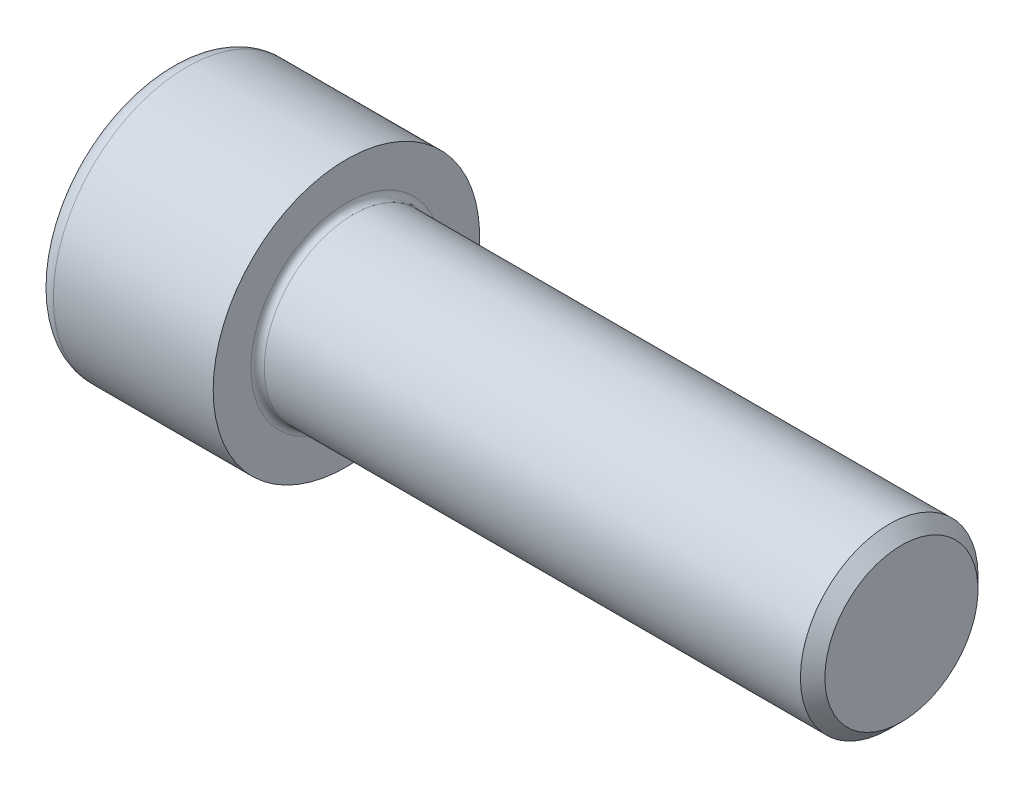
ISO-10303-21;
HEADER;
FILE_DESCRIPTION(('STEP AP214'),'2;1');
FILE_NAME('part.step','',(''),(''),'','','');
FILE_SCHEMA(('AUTOMOTIVE_DESIGN { 1 0 10303 214 1 1 1 1 }'));
ENDSEC;
DATA;
#1=APPLICATION_CONTEXT('core data for automotive mechanical design processes');
#2=APPLICATION_PROTOCOL_DEFINITION('international standard','automotive_design',2000,#1);
#3=PRODUCT_CONTEXT('',#1,'mechanical');
#4=PRODUCT('Part','Part','',(#3));
#5=PRODUCT_RELATED_PRODUCT_CATEGORY('part','',(#4));
#6=PRODUCT_DEFINITION_FORMATION('','',#4);
#7=PRODUCT_DEFINITION_CONTEXT('part definition',#1,'design');
#8=PRODUCT_DEFINITION('design','',#6,#7);
#9=PRODUCT_DEFINITION_SHAPE('','',#8);
#10=(LENGTH_UNIT() NAMED_UNIT(*) SI_UNIT(.MILLI.,.METRE.));
#11=(NAMED_UNIT(*) PLANE_ANGLE_UNIT() SI_UNIT($,.RADIAN.));
#12=(NAMED_UNIT(*) SI_UNIT($,.STERADIAN.) SOLID_ANGLE_UNIT());
#13=UNCERTAINTY_MEASURE_WITH_UNIT(LENGTH_MEASURE(1.E-05),#10,'distance_accuracy_value','');
#14=(GEOMETRIC_REPRESENTATION_CONTEXT(3) GLOBAL_UNCERTAINTY_ASSIGNED_CONTEXT((#13)) GLOBAL_UNIT_ASSIGNED_CONTEXT((#10,
#11,#12)) REPRESENTATION_CONTEXT('',''));
#15=CARTESIAN_POINT('',(0.,0.,0.));
#16=DIRECTION('',(0.,0.,1.));
#17=DIRECTION('',(1.,0.,0.));
#18=AXIS2_PLACEMENT_3D('',#15,#16,#17);
#19=CARTESIAN_POINT('',(0.,0.,0.));
#20=DIRECTION('',(-1.,0.,0.));
#21=DIRECTION('',(0.,0.,1.));
#22=AXIS2_PLACEMENT_3D('',#19,#20,#21);
#23=PLANE('',#22);
#24=DIRECTION('',(0.,-0.499999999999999,0.866025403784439));
#25=VECTOR('',#24,1.);
#26=CARTESIAN_POINT('',(0.,8.10137897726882,0.));
#27=LINE('',#26,#25);
#28=CARTESIAN_POINT('',(0.,8.10137897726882,0.));
#29=VERTEX_POINT('',#28);
#30=CARTESIAN_POINT('',(0.,4.05068948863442,7.01599999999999));
#31=VERTEX_POINT('',#30);
#32=EDGE_CURVE('E259',#29,#31,#27,.T.);
#33=ORIENTED_EDGE('',*,*,#32,.T.);
#34=DIRECTION('',(0.,1.,0.));
#35=VECTOR('',#34,1.);
#36=CARTESIAN_POINT('',(0.,-4.05068948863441,7.016));
#37=LINE('',#36,#35);
#38=CARTESIAN_POINT('',(0.,-4.05068948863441,7.016));
#39=VERTEX_POINT('',#38);
#40=EDGE_CURVE('E131',#39,#31,#37,.T.);
#41=ORIENTED_EDGE('',*,*,#40,.F.);
#42=DIRECTION('',(0.,-0.500000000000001,-0.866025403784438));
#43=VECTOR('',#42,1.);
#44=CARTESIAN_POINT('',(0.,-4.05068948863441,7.016));
#45=LINE('',#44,#43);
#46=CARTESIAN_POINT('',(0.,-8.10137897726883,0.));
#47=VERTEX_POINT('',#46);
#48=EDGE_CURVE('E262',#39,#47,#45,.T.);
#49=ORIENTED_EDGE('',*,*,#48,.T.);
#50=DIRECTION('',(0.,0.499999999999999,-0.866025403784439));
#51=VECTOR('',#50,1.);
#52=CARTESIAN_POINT('',(0.,-8.10137897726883,0.));
#53=LINE('',#52,#51);
#54=CARTESIAN_POINT('',(0.,-4.05068948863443,-7.016));
#55=VERTEX_POINT('',#54);
#56=EDGE_CURVE('E265',#47,#55,#53,.T.);
#57=ORIENTED_EDGE('',*,*,#56,.T.);
#58=DIRECTION('',(0.,-1.,0.));
#59=VECTOR('',#58,1.);
#60=CARTESIAN_POINT('',(0.,4.0506894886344,-7.01600000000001));
#61=LINE('',#60,#59);
#62=CARTESIAN_POINT('',(0.,4.0506894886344,-7.01600000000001));
#63=VERTEX_POINT('',#62);
#64=EDGE_CURVE('E268',#63,#55,#61,.T.);
#65=ORIENTED_EDGE('',*,*,#64,.F.);
#66=DIRECTION('',(0.,-0.500000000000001,-0.866025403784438));
#67=VECTOR('',#66,1.);
#68=CARTESIAN_POINT('',(0.,8.10137897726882,0.));
#69=LINE('',#68,#67);
#70=EDGE_CURVE('E126',#29,#63,#69,.T.);
#71=ORIENTED_EDGE('',*,*,#70,.F.);
#72=EDGE_LOOP('',(#33,#41,#49,#57,#65,#71));
#73=FACE_BOUND('',#72,.T.);
#74=CARTESIAN_POINT('',(0.,0.,0.));
#75=DIRECTION('',(-1.,0.,0.));
#76=DIRECTION('',(0.,0.,1.));
#77=AXIS2_PLACEMENT_3D('',#74,#75,#76);
#78=CIRCLE('',#77,10.4);
#79=CARTESIAN_POINT('',(0.,0.,10.4));
#80=VERTEX_POINT('',#79);
#81=EDGE_CURVE('E43',#80,#80,#78,.T.);
#82=ORIENTED_EDGE('',*,*,#81,.T.);
#83=EDGE_LOOP('',(#82));
#84=FACE_BOUND('',#83,.T.);
#85=ADVANCED_FACE('F35',(#73,#84),#23,.T.);
#86=CARTESIAN_POINT('',(-31.75,0.,0.));
#87=DIRECTION('',(-1.,0.,0.));
#88=DIRECTION('',(0.,0.,1.));
#89=AXIS2_PLACEMENT_3D('',#86,#87,#88);
#90=CYLINDRICAL_SURFACE('',#89,12.);
#91=CARTESIAN_POINT('',(1.6,0.,0.));
#92=DIRECTION('',(-1.,0.,0.));
#93=DIRECTION('',(0.,0.,1.));
#94=AXIS2_PLACEMENT_3D('',#91,#92,#93);
#95=CIRCLE('',#94,12.);
#96=CARTESIAN_POINT('',(1.6,0.,12.));
#97=VERTEX_POINT('',#96);
#98=EDGE_CURVE('E11',#97,#97,#95,.F.);
#99=ORIENTED_EDGE('',*,*,#98,.T.);
#100=EDGE_LOOP('',(#99));
#101=FACE_BOUND('',#100,.T.);
#102=CARTESIAN_POINT('',(16.,0.,0.));
#103=DIRECTION('',(-1.,0.,0.));
#104=DIRECTION('',(0.,0.,1.));
#105=AXIS2_PLACEMENT_3D('',#102,#103,#104);
#106=CIRCLE('',#105,12.);
#107=CARTESIAN_POINT('',(16.,0.,12.));
#108=VERTEX_POINT('',#107);
#109=EDGE_CURVE('E149',#108,#108,#106,.T.);
#110=ORIENTED_EDGE('',*,*,#109,.T.);
#111=EDGE_LOOP('',(#110));
#112=FACE_BOUND('',#111,.T.);
#113=ADVANCED_FACE('F173',(#101,#112),#90,.T.);
#114=CARTESIAN_POINT('',(16.,12.,0.));
#115=DIRECTION('',(1.,0.,0.));
#116=DIRECTION('',(0.,0.,-1.));
#117=AXIS2_PLACEMENT_3D('',#114,#115,#116);
#118=PLANE('',#117);
#119=CARTESIAN_POINT('',(16.,0.,0.));
#120=DIRECTION('',(1.,0.,0.));
#121=DIRECTION('',(0.,0.,-1.));
#122=AXIS2_PLACEMENT_3D('',#119,#120,#121);
#123=CIRCLE('',#122,8.59999999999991);
#124=CARTESIAN_POINT('',(16.,0.,-8.59999999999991));
#125=VERTEX_POINT('',#124);
#126=EDGE_CURVE('E152',#125,#125,#123,.F.);
#127=ORIENTED_EDGE('',*,*,#126,.T.);
#128=EDGE_LOOP('',(#127));
#129=FACE_BOUND('',#128,.T.);
#130=ORIENTED_EDGE('',*,*,#109,.F.);
#131=EDGE_LOOP('',(#130));
#132=FACE_BOUND('',#131,.T.);
#133=ADVANCED_FACE('F179',(#129,#132),#118,.T.);
#134=CARTESIAN_POINT('',(-31.75,0.,0.));
#135=DIRECTION('',(-1.,0.,0.));
#136=DIRECTION('',(0.,0.,1.));
#137=AXIS2_PLACEMENT_3D('',#134,#135,#136);
#138=CYLINDRICAL_SURFACE('',#137,7.99999999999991);
#139=CARTESIAN_POINT('',(16.6,0.,0.));
#140=DIRECTION('',(1.,0.,0.));
#141=DIRECTION('',(0.,0.,-1.));
#142=AXIS2_PLACEMENT_3D('',#139,#140,#141);
#143=CIRCLE('',#142,7.99999999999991);
#144=CARTESIAN_POINT('',(16.6,0.,-7.99999999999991));
#145=VERTEX_POINT('',#144);
#146=EDGE_CURVE('E155',#145,#145,#143,.T.);
#147=ORIENTED_EDGE('',*,*,#146,.T.);
#148=EDGE_LOOP('',(#147));
#149=FACE_BOUND('',#148,.T.);
#150=CARTESIAN_POINT('',(64.8984999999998,0.,0.));
#151=DIRECTION('',(-1.,0.,0.));
#152=DIRECTION('',(0.,0.,1.));
#153=AXIS2_PLACEMENT_3D('',#150,#151,#152);
#154=CIRCLE('',#153,7.99999999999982);
#155=CARTESIAN_POINT('',(64.8984999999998,0.,7.99999999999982));
#156=VERTEX_POINT('',#155);
#157=EDGE_CURVE('E146',#156,#156,#154,.T.);
#158=ORIENTED_EDGE('',*,*,#157,.T.);
#159=EDGE_LOOP('',(#158));
#160=FACE_BOUND('',#159,.T.);
#161=ADVANCED_FACE('F185',(#149,#160),#138,.T.);
#162=CARTESIAN_POINT('',(66.,0.,0.));
#163=DIRECTION('',(-1.,0.,0.));
#164=DIRECTION('',(0.,0.,1.));
#165=AXIS2_PLACEMENT_3D('',#162,#163,#164);
#166=CONICAL_SURFACE('',#165,6.8985,0.785398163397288);
#167=ORIENTED_EDGE('',*,*,#157,.F.);
#168=EDGE_LOOP('',(#167));
#169=FACE_BOUND('',#168,.T.);
#170=CARTESIAN_POINT('',(66.,0.,0.));
#171=DIRECTION('',(-1.,0.,0.));
#172=DIRECTION('',(0.,0.,1.));
#173=AXIS2_PLACEMENT_3D('',#170,#171,#172);
#174=CIRCLE('',#173,6.8985);
#175=CARTESIAN_POINT('',(66.,0.,6.8985));
#176=VERTEX_POINT('',#175);
#177=EDGE_CURVE('E142',#176,#176,#174,.T.);
#178=ORIENTED_EDGE('',*,*,#177,.T.);
#179=EDGE_LOOP('',(#178));
#180=FACE_BOUND('',#179,.T.);
#181=ADVANCED_FACE('F189',(#169,#180),#166,.T.);
#182=CARTESIAN_POINT('',(66.,6.8985,0.));
#183=DIRECTION('',(1.,0.,0.));
#184=DIRECTION('',(0.,0.,-1.));
#185=AXIS2_PLACEMENT_3D('',#182,#183,#184);
#186=PLANE('',#185);
#187=ORIENTED_EDGE('',*,*,#177,.F.);
#188=EDGE_LOOP('',(#187));
#189=FACE_BOUND('',#188,.T.);
#190=ADVANCED_FACE('F169',(#189),#186,.T.);
#191=CARTESIAN_POINT('',(16.6,0.,0.));
#192=DIRECTION('',(1.,0.,0.));
#193=DIRECTION('',(0.,0.,-1.));
#194=AXIS2_PLACEMENT_3D('',#191,#192,#193);
#195=TOROIDAL_SURFACE('',#194,8.59999999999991,0.6);
#196=ORIENTED_EDGE('',*,*,#146,.F.);
#197=EDGE_LOOP('',(#196));
#198=FACE_BOUND('',#197,.T.);
#199=ORIENTED_EDGE('',*,*,#126,.F.);
#200=EDGE_LOOP('',(#199));
#201=FACE_BOUND('',#200,.T.);
#202=ADVANCED_FACE('F162',(#198,#201),#195,.F.);
#203=CARTESIAN_POINT('',(1.6,0.,0.));
#204=DIRECTION('',(-1.,0.,0.));
#205=DIRECTION('',(0.,0.,1.));
#206=AXIS2_PLACEMENT_3D('',#203,#204,#205);
#207=TOROIDAL_SURFACE('',#206,10.4,1.6);
#208=ORIENTED_EDGE('',*,*,#98,.F.);
#209=EDGE_LOOP('',(#208));
#210=FACE_BOUND('',#209,.T.);
#211=ORIENTED_EDGE('',*,*,#81,.F.);
#212=EDGE_LOOP('',(#211));
#213=FACE_BOUND('',#212,.T.);
#214=ADVANCED_FACE('F37',(#210,#213),#207,.T.);
#215=CARTESIAN_POINT('',(8.,8.10137897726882,0.));
#216=DIRECTION('',(0.,-0.866025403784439,-0.499999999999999));
#217=DIRECTION('',(0.,0.499999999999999,-0.866025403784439));
#218=AXIS2_PLACEMENT_3D('',#215,#216,#217);
#219=PLANE('',#218);
#220=ORIENTED_EDGE('',*,*,#32,.F.);
#221=DIRECTION('',(-1.,0.,0.));
#222=VECTOR('',#221,1.);
#223=CARTESIAN_POINT('',(8.,8.10137897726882,0.));
#224=LINE('',#223,#222);
#225=CARTESIAN_POINT('',(8.,8.10137897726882,0.));
#226=VERTEX_POINT('',#225);
#227=EDGE_CURVE('E249',#226,#29,#224,.T.);
#228=ORIENTED_EDGE('',*,*,#227,.F.);
#229=DIRECTION('',(0.,-0.499999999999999,0.866025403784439));
#230=VECTOR('',#229,1.);
#231=CARTESIAN_POINT('',(8.,8.10137897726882,0.));
#232=LINE('',#231,#230);
#233=CARTESIAN_POINT('',(8.,6.07603423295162,3.50799999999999));
#234=VERTEX_POINT('',#233);
#235=EDGE_CURVE('E118',#226,#234,#232,.T.);
#236=ORIENTED_EDGE('',*,*,#235,.T.);
#237=CARTESIAN_POINT('',(8.,4.05068948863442,7.01599999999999));
#238=VERTEX_POINT('',#237);
#239=EDGE_CURVE('E109',#234,#238,#232,.T.);
#240=ORIENTED_EDGE('',*,*,#239,.T.);
#241=DIRECTION('',(-1.,0.,0.));
#242=VECTOR('',#241,1.);
#243=CARTESIAN_POINT('',(8.,4.05068948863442,7.01599999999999));
#244=LINE('',#243,#242);
#245=EDGE_CURVE('E123',#238,#31,#244,.T.);
#246=ORIENTED_EDGE('',*,*,#245,.T.);
#247=EDGE_LOOP('',(#220,#228,#236,#240,#246));
#248=FACE_BOUND('',#247,.T.);
#249=ADVANCED_FACE('F122',(#248),#219,.T.);
#250=CARTESIAN_POINT('',(8.,-4.05068948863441,7.016));
#251=DIRECTION('',(0.,0.,1.));
#252=DIRECTION('',(0.,-1.,0.));
#253=AXIS2_PLACEMENT_3D('',#250,#251,#252);
#254=PLANE('',#253);
#255=ORIENTED_EDGE('',*,*,#40,.T.);
#256=ORIENTED_EDGE('',*,*,#245,.F.);
#257=DIRECTION('',(0.,1.,0.));
#258=VECTOR('',#257,1.);
#259=CARTESIAN_POINT('',(8.,-4.05068948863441,7.016));
#260=LINE('',#259,#258);
#261=CARTESIAN_POINT('',(8.,0.,7.016));
#262=VERTEX_POINT('',#261);
#263=EDGE_CURVE('E106',#262,#238,#260,.T.);
#264=ORIENTED_EDGE('',*,*,#263,.F.);
#265=CARTESIAN_POINT('',(8.,-4.05068948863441,7.016));
#266=VERTEX_POINT('',#265);
#267=EDGE_CURVE('E117',#266,#262,#260,.T.);
#268=ORIENTED_EDGE('',*,*,#267,.F.);
#269=DIRECTION('',(-1.,0.,0.));
#270=VECTOR('',#269,1.);
#271=CARTESIAN_POINT('',(8.,-4.05068948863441,7.016));
#272=LINE('',#271,#270);
#273=EDGE_CURVE('E133',#266,#39,#272,.T.);
#274=ORIENTED_EDGE('',*,*,#273,.T.);
#275=EDGE_LOOP('',(#255,#256,#264,#268,#274));
#276=FACE_BOUND('',#275,.T.);
#277=ADVANCED_FACE('F128',(#276),#254,.F.);
#278=CARTESIAN_POINT('',(8.,-4.05068948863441,7.016));
#279=DIRECTION('',(0.,0.866025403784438,-0.500000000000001));
#280=DIRECTION('',(0.,0.500000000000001,0.866025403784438));
#281=AXIS2_PLACEMENT_3D('',#278,#279,#280);
#282=PLANE('',#281);
#283=ORIENTED_EDGE('',*,*,#48,.F.);
#284=ORIENTED_EDGE('',*,*,#273,.F.);
#285=DIRECTION('',(0.,-0.500000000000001,-0.866025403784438));
#286=VECTOR('',#285,1.);
#287=CARTESIAN_POINT('',(8.,-4.05068948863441,7.016));
#288=LINE('',#287,#286);
#289=CARTESIAN_POINT('',(8.,-6.07603423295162,3.50800000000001));
#290=VERTEX_POINT('',#289);
#291=EDGE_CURVE('E288',#266,#290,#288,.T.);
#292=ORIENTED_EDGE('',*,*,#291,.T.);
#293=CARTESIAN_POINT('',(8.,-8.10137897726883,0.));
#294=VERTEX_POINT('',#293);
#295=EDGE_CURVE('E277',#290,#294,#288,.T.);
#296=ORIENTED_EDGE('',*,*,#295,.T.);
#297=DIRECTION('',(-1.,0.,0.));
#298=VECTOR('',#297,1.);
#299=CARTESIAN_POINT('',(8.,-8.10137897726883,0.));
#300=LINE('',#299,#298);
#301=EDGE_CURVE('E138',#294,#47,#300,.T.);
#302=ORIENTED_EDGE('',*,*,#301,.T.);
#303=EDGE_LOOP('',(#283,#284,#292,#296,#302));
#304=FACE_BOUND('',#303,.T.);
#305=ADVANCED_FACE('F203',(#304),#282,.T.);
#306=CARTESIAN_POINT('',(8.,-8.10137897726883,0.));
#307=DIRECTION('',(0.,0.866025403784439,0.499999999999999));
#308=DIRECTION('',(0.,-0.499999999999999,0.866025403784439));
#309=AXIS2_PLACEMENT_3D('',#306,#307,#308);
#310=PLANE('',#309);
#311=ORIENTED_EDGE('',*,*,#56,.F.);
#312=ORIENTED_EDGE('',*,*,#301,.F.);
#313=DIRECTION('',(0.,0.499999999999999,-0.866025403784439));
#314=VECTOR('',#313,1.);
#315=CARTESIAN_POINT('',(8.,-8.10137897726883,0.));
#316=LINE('',#315,#314);
#317=CARTESIAN_POINT('',(8.,-6.07603423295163,-3.50799999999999));
#318=VERTEX_POINT('',#317);
#319=EDGE_CURVE('E255',#294,#318,#316,.T.);
#320=ORIENTED_EDGE('',*,*,#319,.T.);
#321=CARTESIAN_POINT('',(8.,-4.05068948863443,-7.016));
#322=VERTEX_POINT('',#321);
#323=EDGE_CURVE('E287',#318,#322,#316,.T.);
#324=ORIENTED_EDGE('',*,*,#323,.T.);
#325=DIRECTION('',(-1.,0.,0.));
#326=VECTOR('',#325,1.);
#327=CARTESIAN_POINT('',(8.,-4.05068948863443,-7.016));
#328=LINE('',#327,#326);
#329=EDGE_CURVE('E248',#322,#55,#328,.T.);
#330=ORIENTED_EDGE('',*,*,#329,.T.);
#331=EDGE_LOOP('',(#311,#312,#320,#324,#330));
#332=FACE_BOUND('',#331,.T.);
#333=ADVANCED_FACE('F206',(#332),#310,.T.);
#334=CARTESIAN_POINT('',(8.,4.0506894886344,-7.01600000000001));
#335=DIRECTION('',(0.,0.,-1.));
#336=DIRECTION('',(0.,1.,0.));
#337=AXIS2_PLACEMENT_3D('',#334,#335,#336);
#338=PLANE('',#337);
#339=ORIENTED_EDGE('',*,*,#64,.T.);
#340=ORIENTED_EDGE('',*,*,#329,.F.);
#341=DIRECTION('',(0.,-1.,0.));
#342=VECTOR('',#341,1.);
#343=CARTESIAN_POINT('',(8.,4.0506894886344,-7.01600000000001));
#344=LINE('',#343,#342);
#345=CARTESIAN_POINT('',(8.,0.,-7.016));
#346=VERTEX_POINT('',#345);
#347=EDGE_CURVE('E252',#346,#322,#344,.T.);
#348=ORIENTED_EDGE('',*,*,#347,.F.);
#349=CARTESIAN_POINT('',(8.,4.0506894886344,-7.01600000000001));
#350=VERTEX_POINT('',#349);
#351=EDGE_CURVE('E50',#350,#346,#344,.T.);
#352=ORIENTED_EDGE('',*,*,#351,.F.);
#353=DIRECTION('',(-1.,0.,0.));
#354=VECTOR('',#353,1.);
#355=CARTESIAN_POINT('',(8.,4.0506894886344,-7.01600000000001));
#356=LINE('',#355,#354);
#357=EDGE_CURVE('E245',#350,#63,#356,.T.);
#358=ORIENTED_EDGE('',*,*,#357,.T.);
#359=EDGE_LOOP('',(#339,#340,#348,#352,#358));
#360=FACE_BOUND('',#359,.T.);
#361=ADVANCED_FACE('F210',(#360),#338,.F.);
#362=CARTESIAN_POINT('',(8.,8.10137897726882,0.));
#363=DIRECTION('',(0.,0.866025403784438,-0.500000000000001));
#364=DIRECTION('',(0.,0.500000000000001,0.866025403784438));
#365=AXIS2_PLACEMENT_3D('',#362,#363,#364);
#366=PLANE('',#365);
#367=ORIENTED_EDGE('',*,*,#70,.T.);
#368=ORIENTED_EDGE('',*,*,#357,.F.);
#369=DIRECTION('',(0.,-0.500000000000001,-0.866025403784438));
#370=VECTOR('',#369,1.);
#371=CARTESIAN_POINT('',(8.,8.10137897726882,0.));
#372=LINE('',#371,#370);
#373=CARTESIAN_POINT('',(8.,6.07603423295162,-3.50800000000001));
#374=VERTEX_POINT('',#373);
#375=EDGE_CURVE('E235',#374,#350,#372,.T.);
#376=ORIENTED_EDGE('',*,*,#375,.F.);
#377=EDGE_CURVE('E241',#226,#374,#372,.T.);
#378=ORIENTED_EDGE('',*,*,#377,.F.);
#379=ORIENTED_EDGE('',*,*,#227,.T.);
#380=EDGE_LOOP('',(#367,#368,#376,#378,#379));
#381=FACE_BOUND('',#380,.T.);
#382=ADVANCED_FACE('F214',(#381),#366,.F.);
#383=CARTESIAN_POINT('',(8.,12.1520684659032,-7.01600000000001));
#384=DIRECTION('',(1.,0.,0.));
#385=DIRECTION('',(0.,0.,-1.));
#386=AXIS2_PLACEMENT_3D('',#383,#384,#385);
#387=PLANE('',#386);
#388=ORIENTED_EDGE('',*,*,#347,.T.);
#389=ORIENTED_EDGE('',*,*,#323,.F.);
#390=CARTESIAN_POINT('',(8.,0.,0.));
#391=DIRECTION('',(-1.,0.,0.));
#392=DIRECTION('',(0.,0.,1.));
#393=AXIS2_PLACEMENT_3D('',#390,#391,#392);
#394=CIRCLE('',#393,7.016);
#395=EDGE_CURVE('E283',#346,#318,#394,.T.);
#396=ORIENTED_EDGE('',*,*,#395,.F.);
#397=EDGE_LOOP('',(#388,#389,#396));
#398=FACE_BOUND('',#397,.T.);
#399=ADVANCED_FACE('F218',(#398),#387,.F.);
#400=ORIENTED_EDGE('',*,*,#319,.F.);
#401=ORIENTED_EDGE('',*,*,#295,.F.);
#402=EDGE_CURVE('E136',#318,#290,#394,.T.);
#403=ORIENTED_EDGE('',*,*,#402,.F.);
#404=EDGE_LOOP('',(#400,#401,#403));
#405=FACE_BOUND('',#404,.T.);
#406=ADVANCED_FACE('F221',(#405),#387,.F.);
#407=ORIENTED_EDGE('',*,*,#291,.F.);
#408=ORIENTED_EDGE('',*,*,#267,.T.);
#409=EDGE_CURVE('E132',#290,#262,#394,.T.);
#410=ORIENTED_EDGE('',*,*,#409,.F.);
#411=EDGE_LOOP('',(#407,#408,#410));
#412=FACE_BOUND('',#411,.T.);
#413=ADVANCED_FACE('F226',(#412),#387,.F.);
#414=ORIENTED_EDGE('',*,*,#263,.T.);
#415=ORIENTED_EDGE('',*,*,#239,.F.);
#416=EDGE_CURVE('E112',#262,#234,#394,.T.);
#417=ORIENTED_EDGE('',*,*,#416,.F.);
#418=EDGE_LOOP('',(#414,#415,#417));
#419=FACE_BOUND('',#418,.T.);
#420=ADVANCED_FACE('F108',(#419),#387,.F.);
#421=ORIENTED_EDGE('',*,*,#235,.F.);
#422=ORIENTED_EDGE('',*,*,#377,.T.);
#423=EDGE_CURVE('E143',#234,#374,#394,.T.);
#424=ORIENTED_EDGE('',*,*,#423,.F.);
#425=EDGE_LOOP('',(#421,#422,#424));
#426=FACE_BOUND('',#425,.T.);
#427=ADVANCED_FACE('F229',(#426),#387,.F.);
#428=ORIENTED_EDGE('',*,*,#375,.T.);
#429=ORIENTED_EDGE('',*,*,#351,.T.);
#430=EDGE_CURVE('E238',#374,#346,#394,.T.);
#431=ORIENTED_EDGE('',*,*,#430,.F.);
#432=EDGE_LOOP('',(#428,#429,#431));
#433=FACE_BOUND('',#432,.T.);
#434=ADVANCED_FACE('F199',(#433),#387,.F.);
#435=CARTESIAN_POINT('',(8.,0.,0.));
#436=DIRECTION('',(-1.,0.,0.));
#437=DIRECTION('',(0.,0.,1.));
#438=AXIS2_PLACEMENT_3D('',#435,#436,#437);
#439=CONICAL_SURFACE('',#438,7.016,1.04719755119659);
#440=CARTESIAN_POINT('',(12.0506894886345,0.,0.));
#441=VERTEX_POINT('',#440);
#442=VERTEX_LOOP('',#441);
#443=FACE_BOUND('',#442,.T.);
#444=ORIENTED_EDGE('',*,*,#416,.T.);
#445=ORIENTED_EDGE('',*,*,#423,.T.);
#446=ORIENTED_EDGE('',*,*,#430,.T.);
#447=ORIENTED_EDGE('',*,*,#395,.T.);
#448=ORIENTED_EDGE('',*,*,#402,.T.);
#449=ORIENTED_EDGE('',*,*,#409,.T.);
#450=EDGE_LOOP('',(#444,#445,#446,#447,#448,#449));
#451=FACE_BOUND('',#450,.T.);
#452=ADVANCED_FACE('F197',(#443,#451),#439,.F.);
#453=CLOSED_SHELL('',(#85,#113,#133,#161,#181,#190,#202,#214,#249,#277,#305,#333,#361,#382,#399,
#406,#413,#420,#427,#434,#452));
#454=MANIFOLD_SOLID_BREP('B2',#453);
#455=ADVANCED_BREP_SHAPE_REPRESENTATION('',(#18,#454),#14);
#456=SHAPE_DEFINITION_REPRESENTATION(#9,#455);
ENDSEC;
END-ISO-10303-21;
